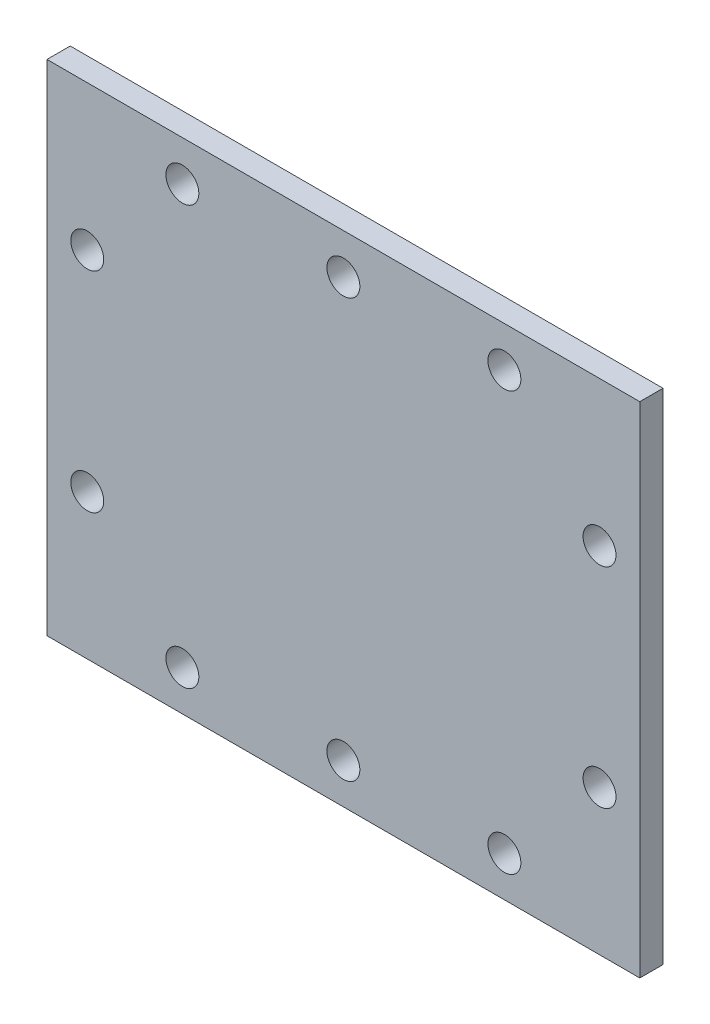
ISO-10303-21;
HEADER;
FILE_DESCRIPTION(('STEP AP214'),'2;1');
FILE_NAME('part.step','',(''),(''),'','','');
FILE_SCHEMA(('AUTOMOTIVE_DESIGN { 1 0 10303 214 1 1 1 1 }'));
ENDSEC;
DATA;
#1=APPLICATION_CONTEXT('core data for automotive mechanical design processes');
#2=APPLICATION_PROTOCOL_DEFINITION('international standard','automotive_design',2000,#1);
#3=PRODUCT_CONTEXT('',#1,'mechanical');
#4=PRODUCT('Part','Part','',(#3));
#5=PRODUCT_RELATED_PRODUCT_CATEGORY('part','',(#4));
#6=PRODUCT_DEFINITION_FORMATION('','',#4);
#7=PRODUCT_DEFINITION_CONTEXT('part definition',#1,'design');
#8=PRODUCT_DEFINITION('design','',#6,#7);
#9=PRODUCT_DEFINITION_SHAPE('','',#8);
#10=(LENGTH_UNIT() NAMED_UNIT(*) SI_UNIT(.MILLI.,.METRE.));
#11=(NAMED_UNIT(*) PLANE_ANGLE_UNIT() SI_UNIT($,.RADIAN.));
#12=(NAMED_UNIT(*) SI_UNIT($,.STERADIAN.) SOLID_ANGLE_UNIT());
#13=UNCERTAINTY_MEASURE_WITH_UNIT(LENGTH_MEASURE(1.E-05),#10,'distance_accuracy_value','');
#14=(GEOMETRIC_REPRESENTATION_CONTEXT(3) GLOBAL_UNCERTAINTY_ASSIGNED_CONTEXT((#13)) GLOBAL_UNIT_ASSIGNED_CONTEXT((#10,
#11,#12)) REPRESENTATION_CONTEXT('',''));
#15=CARTESIAN_POINT('',(0.,0.,0.));
#16=DIRECTION('',(0.,0.,1.));
#17=DIRECTION('',(1.,0.,0.));
#18=AXIS2_PLACEMENT_3D('',#15,#16,#17);
#19=CARTESIAN_POINT('',(0.,0.,3.175));
#20=DIRECTION('',(1.,0.,0.));
#21=DIRECTION('',(0.,1.,0.));
#22=AXIS2_PLACEMENT_3D('',#19,#20,#21);
#23=PLANE('',#22);
#24=DIRECTION('',(0.,-1.,0.));
#25=VECTOR('',#24,1.);
#26=CARTESIAN_POINT('',(0.,0.,0.));
#27=LINE('',#26,#25);
#28=CARTESIAN_POINT('',(0.,68.2,0.));
#29=VERTEX_POINT('',#28);
#30=CARTESIAN_POINT('',(0.,0.,0.));
#31=VERTEX_POINT('',#30);
#32=EDGE_CURVE('E257',#29,#31,#27,.T.);
#33=ORIENTED_EDGE('',*,*,#32,.T.);
#34=DIRECTION('',(0.,0.,-1.));
#35=VECTOR('',#34,1.);
#36=CARTESIAN_POINT('',(0.,0.,3.175));
#37=LINE('',#36,#35);
#38=CARTESIAN_POINT('',(0.,0.,3.175));
#39=VERTEX_POINT('',#38);
#40=EDGE_CURVE('E12',#39,#31,#37,.T.);
#41=ORIENTED_EDGE('',*,*,#40,.F.);
#42=DIRECTION('',(0.,-1.,0.));
#43=VECTOR('',#42,1.);
#44=CARTESIAN_POINT('',(0.,0.,3.175));
#45=LINE('',#44,#43);
#46=CARTESIAN_POINT('',(0.,68.2,3.175));
#47=VERTEX_POINT('',#46);
#48=EDGE_CURVE('E111',#47,#39,#45,.T.);
#49=ORIENTED_EDGE('',*,*,#48,.F.);
#50=DIRECTION('',(0.,0.,-1.));
#51=VECTOR('',#50,1.);
#52=CARTESIAN_POINT('',(0.,68.2,3.175));
#53=LINE('',#52,#51);
#54=EDGE_CURVE('E124',#47,#29,#53,.T.);
#55=ORIENTED_EDGE('',*,*,#54,.T.);
#56=EDGE_LOOP('',(#33,#41,#49,#55));
#57=FACE_BOUND('',#56,.T.);
#58=ADVANCED_FACE('F49',(#57),#23,.F.);
#59=CARTESIAN_POINT('',(0.,0.,3.175));
#60=DIRECTION('',(0.,1.,0.));
#61=DIRECTION('',(0.,0.,1.));
#62=AXIS2_PLACEMENT_3D('',#59,#60,#61);
#63=PLANE('',#62);
#64=DIRECTION('',(1.,0.,0.));
#65=VECTOR('',#64,1.);
#66=CARTESIAN_POINT('',(0.,0.,0.));
#67=LINE('',#66,#65);
#68=CARTESIAN_POINT('',(81.,0.,0.));
#69=VERTEX_POINT('',#68);
#70=EDGE_CURVE('E116',#31,#69,#67,.T.);
#71=ORIENTED_EDGE('',*,*,#70,.T.);
#72=DIRECTION('',(0.,0.,-1.));
#73=VECTOR('',#72,1.);
#74=CARTESIAN_POINT('',(81.,0.,3.175));
#75=LINE('',#74,#73);
#76=CARTESIAN_POINT('',(81.,0.,3.175));
#77=VERTEX_POINT('',#76);
#78=EDGE_CURVE('E60',#77,#69,#75,.T.);
#79=ORIENTED_EDGE('',*,*,#78,.F.);
#80=DIRECTION('',(1.,0.,0.));
#81=VECTOR('',#80,1.);
#82=CARTESIAN_POINT('',(0.,0.,3.175));
#83=LINE('',#82,#81);
#84=EDGE_CURVE('E106',#39,#77,#83,.T.);
#85=ORIENTED_EDGE('',*,*,#84,.F.);
#86=ORIENTED_EDGE('',*,*,#40,.T.);
#87=EDGE_LOOP('',(#71,#79,#85,#86));
#88=FACE_BOUND('',#87,.T.);
#89=ADVANCED_FACE('F115',(#88),#63,.F.);
#90=CARTESIAN_POINT('',(81.,0.,3.175));
#91=DIRECTION('',(-1.,0.,0.));
#92=DIRECTION('',(0.,-1.,0.));
#93=AXIS2_PLACEMENT_3D('',#90,#91,#92);
#94=PLANE('',#93);
#95=DIRECTION('',(0.,1.,0.));
#96=VECTOR('',#95,1.);
#97=CARTESIAN_POINT('',(81.,0.,0.));
#98=LINE('',#97,#96);
#99=CARTESIAN_POINT('',(81.,68.2,0.));
#100=VERTEX_POINT('',#99);
#101=EDGE_CURVE('E91',#69,#100,#98,.T.);
#102=ORIENTED_EDGE('',*,*,#101,.T.);
#103=DIRECTION('',(0.,0.,-1.));
#104=VECTOR('',#103,1.);
#105=CARTESIAN_POINT('',(81.,68.2,3.175));
#106=LINE('',#105,#104);
#107=CARTESIAN_POINT('',(81.,68.2,3.175));
#108=VERTEX_POINT('',#107);
#109=EDGE_CURVE('E118',#108,#100,#106,.T.);
#110=ORIENTED_EDGE('',*,*,#109,.F.);
#111=DIRECTION('',(0.,1.,0.));
#112=VECTOR('',#111,1.);
#113=CARTESIAN_POINT('',(81.,0.,3.175));
#114=LINE('',#113,#112);
#115=EDGE_CURVE('E109',#77,#108,#114,.T.);
#116=ORIENTED_EDGE('',*,*,#115,.F.);
#117=ORIENTED_EDGE('',*,*,#78,.T.);
#118=EDGE_LOOP('',(#102,#110,#116,#117));
#119=FACE_BOUND('',#118,.T.);
#120=ADVANCED_FACE('F119',(#119),#94,.F.);
#121=CARTESIAN_POINT('',(0.,68.2,3.175));
#122=DIRECTION('',(0.,-1.,0.));
#123=DIRECTION('',(0.,0.,-1.));
#124=AXIS2_PLACEMENT_3D('',#121,#122,#123);
#125=PLANE('',#124);
#126=DIRECTION('',(-1.,0.,0.));
#127=VECTOR('',#126,1.);
#128=CARTESIAN_POINT('',(0.,68.2,0.));
#129=LINE('',#128,#127);
#130=EDGE_CURVE('E99',#100,#29,#129,.T.);
#131=ORIENTED_EDGE('',*,*,#130,.T.);
#132=ORIENTED_EDGE('',*,*,#54,.F.);
#133=DIRECTION('',(-1.,0.,0.));
#134=VECTOR('',#133,1.);
#135=CARTESIAN_POINT('',(0.,68.2,3.175));
#136=LINE('',#135,#134);
#137=EDGE_CURVE('E70',#108,#47,#136,.T.);
#138=ORIENTED_EDGE('',*,*,#137,.F.);
#139=ORIENTED_EDGE('',*,*,#109,.T.);
#140=EDGE_LOOP('',(#131,#132,#138,#139));
#141=FACE_BOUND('',#140,.T.);
#142=ADVANCED_FACE('F286',(#141),#125,.F.);
#143=CARTESIAN_POINT('',(0.,0.,3.175));
#144=DIRECTION('',(0.,0.,-1.));
#145=DIRECTION('',(-1.,0.,0.));
#146=AXIS2_PLACEMENT_3D('',#143,#144,#145);
#147=PLANE('',#146);
#148=CARTESIAN_POINT('',(40.5,5.5,3.175));
#149=DIRECTION('',(0.,0.,1.));
#150=DIRECTION('',(1.,0.,0.));
#151=AXIS2_PLACEMENT_3D('',#148,#149,#150);
#152=CIRCLE('',#151,2.25);
#153=CARTESIAN_POINT('',(42.75,5.5,3.175));
#154=VERTEX_POINT('',#153);
#155=EDGE_CURVE('E158',#154,#154,#152,.T.);
#156=ORIENTED_EDGE('',*,*,#155,.F.);
#157=EDGE_LOOP('',(#156));
#158=FACE_BOUND('',#157,.T.);
#159=CARTESIAN_POINT('',(62.5,5.5,3.175));
#160=DIRECTION('',(0.,0.,1.));
#161=DIRECTION('',(1.,0.,0.));
#162=AXIS2_PLACEMENT_3D('',#159,#160,#161);
#163=CIRCLE('',#162,2.25);
#164=CARTESIAN_POINT('',(64.75,5.5,3.175));
#165=VERTEX_POINT('',#164);
#166=EDGE_CURVE('E166',#165,#165,#163,.T.);
#167=ORIENTED_EDGE('',*,*,#166,.F.);
#168=EDGE_LOOP('',(#167));
#169=FACE_BOUND('',#168,.T.);
#170=CARTESIAN_POINT('',(18.5,5.49999999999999,3.175));
#171=DIRECTION('',(0.,0.,1.));
#172=DIRECTION('',(1.,0.,0.));
#173=AXIS2_PLACEMENT_3D('',#170,#171,#172);
#174=CIRCLE('',#173,2.25);
#175=CARTESIAN_POINT('',(20.75,5.49999999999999,3.175));
#176=VERTEX_POINT('',#175);
#177=EDGE_CURVE('E176',#176,#176,#174,.T.);
#178=ORIENTED_EDGE('',*,*,#177,.F.);
#179=EDGE_LOOP('',(#178));
#180=FACE_BOUND('',#179,.T.);
#181=CARTESIAN_POINT('',(5.49999999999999,19.8,3.175));
#182=DIRECTION('',(0.,0.,1.));
#183=DIRECTION('',(1.,0.,0.));
#184=AXIS2_PLACEMENT_3D('',#181,#182,#183);
#185=CIRCLE('',#184,2.25);
#186=CARTESIAN_POINT('',(7.74999999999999,19.8,3.175));
#187=VERTEX_POINT('',#186);
#188=EDGE_CURVE('E188',#187,#187,#185,.T.);
#189=ORIENTED_EDGE('',*,*,#188,.F.);
#190=EDGE_LOOP('',(#189));
#191=FACE_BOUND('',#190,.T.);
#192=CARTESIAN_POINT('',(5.49999999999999,48.4,3.175));
#193=DIRECTION('',(0.,0.,1.));
#194=DIRECTION('',(1.,0.,0.));
#195=AXIS2_PLACEMENT_3D('',#192,#193,#194);
#196=CIRCLE('',#195,2.25);
#197=CARTESIAN_POINT('',(7.74999999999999,48.4,3.175));
#198=VERTEX_POINT('',#197);
#199=EDGE_CURVE('E200',#198,#198,#196,.T.);
#200=ORIENTED_EDGE('',*,*,#199,.F.);
#201=EDGE_LOOP('',(#200));
#202=FACE_BOUND('',#201,.T.);
#203=CARTESIAN_POINT('',(18.5,62.7,3.175));
#204=DIRECTION('',(0.,0.,1.));
#205=DIRECTION('',(1.,0.,0.));
#206=AXIS2_PLACEMENT_3D('',#203,#204,#205);
#207=CIRCLE('',#206,2.25);
#208=CARTESIAN_POINT('',(20.75,62.7,3.175));
#209=VERTEX_POINT('',#208);
#210=EDGE_CURVE('E209',#209,#209,#207,.T.);
#211=ORIENTED_EDGE('',*,*,#210,.F.);
#212=EDGE_LOOP('',(#211));
#213=FACE_BOUND('',#212,.T.);
#214=CARTESIAN_POINT('',(62.5,62.7,3.175));
#215=DIRECTION('',(0.,0.,1.));
#216=DIRECTION('',(1.,0.,0.));
#217=AXIS2_PLACEMENT_3D('',#214,#215,#216);
#218=CIRCLE('',#217,2.25);
#219=CARTESIAN_POINT('',(64.75,62.7,3.175));
#220=VERTEX_POINT('',#219);
#221=EDGE_CURVE('E221',#220,#220,#218,.T.);
#222=ORIENTED_EDGE('',*,*,#221,.F.);
#223=EDGE_LOOP('',(#222));
#224=FACE_BOUND('',#223,.T.);
#225=CARTESIAN_POINT('',(75.5,48.4,3.175));
#226=DIRECTION('',(0.,0.,1.));
#227=DIRECTION('',(1.,0.,0.));
#228=AXIS2_PLACEMENT_3D('',#225,#226,#227);
#229=CIRCLE('',#228,2.25);
#230=CARTESIAN_POINT('',(77.75,48.4,3.175));
#231=VERTEX_POINT('',#230);
#232=EDGE_CURVE('E230',#231,#231,#229,.T.);
#233=ORIENTED_EDGE('',*,*,#232,.F.);
#234=EDGE_LOOP('',(#233));
#235=FACE_BOUND('',#234,.T.);
#236=CARTESIAN_POINT('',(75.5,19.8,3.175));
#237=DIRECTION('',(0.,0.,1.));
#238=DIRECTION('',(1.,0.,0.));
#239=AXIS2_PLACEMENT_3D('',#236,#237,#238);
#240=CIRCLE('',#239,2.25);
#241=CARTESIAN_POINT('',(77.75,19.8,3.175));
#242=VERTEX_POINT('',#241);
#243=EDGE_CURVE('E239',#242,#242,#240,.T.);
#244=ORIENTED_EDGE('',*,*,#243,.F.);
#245=EDGE_LOOP('',(#244));
#246=FACE_BOUND('',#245,.T.);
#247=CARTESIAN_POINT('',(40.5,62.7,3.175));
#248=DIRECTION('',(0.,0.,1.));
#249=DIRECTION('',(1.,0.,0.));
#250=AXIS2_PLACEMENT_3D('',#247,#248,#249);
#251=CIRCLE('',#250,2.25);
#252=CARTESIAN_POINT('',(42.75,62.7,3.175));
#253=VERTEX_POINT('',#252);
#254=EDGE_CURVE('E250',#253,#253,#251,.T.);
#255=ORIENTED_EDGE('',*,*,#254,.F.);
#256=EDGE_LOOP('',(#255));
#257=FACE_BOUND('',#256,.T.);
#258=ORIENTED_EDGE('',*,*,#48,.T.);
#259=ORIENTED_EDGE('',*,*,#84,.T.);
#260=ORIENTED_EDGE('',*,*,#115,.T.);
#261=ORIENTED_EDGE('',*,*,#137,.T.);
#262=EDGE_LOOP('',(#258,#259,#260,#261));
#263=FACE_BOUND('',#262,.T.);
#264=ADVANCED_FACE('F107',(#158,#169,#180,#191,#202,#213,#224,#235,#246,#257,#263),#147,.F.);
#265=CARTESIAN_POINT('',(0.,0.,0.));
#266=DIRECTION('',(0.,0.,-1.));
#267=DIRECTION('',(-1.,0.,0.));
#268=AXIS2_PLACEMENT_3D('',#265,#266,#267);
#269=PLANE('',#268);
#270=CARTESIAN_POINT('',(40.5,5.5,0.));
#271=DIRECTION('',(0.,0.,1.));
#272=DIRECTION('',(1.,0.,0.));
#273=AXIS2_PLACEMENT_3D('',#270,#271,#272);
#274=CIRCLE('',#273,2.25);
#275=CARTESIAN_POINT('',(42.75,5.5,0.));
#276=VERTEX_POINT('',#275);
#277=EDGE_CURVE('E162',#276,#276,#274,.T.);
#278=ORIENTED_EDGE('',*,*,#277,.T.);
#279=EDGE_LOOP('',(#278));
#280=FACE_BOUND('',#279,.T.);
#281=CARTESIAN_POINT('',(62.5,5.5,0.));
#282=DIRECTION('',(0.,0.,1.));
#283=DIRECTION('',(1.,0.,0.));
#284=AXIS2_PLACEMENT_3D('',#281,#282,#283);
#285=CIRCLE('',#284,2.25);
#286=CARTESIAN_POINT('',(64.75,5.5,0.));
#287=VERTEX_POINT('',#286);
#288=EDGE_CURVE('E171',#287,#287,#285,.T.);
#289=ORIENTED_EDGE('',*,*,#288,.T.);
#290=EDGE_LOOP('',(#289));
#291=FACE_BOUND('',#290,.T.);
#292=CARTESIAN_POINT('',(18.5,5.49999999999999,0.));
#293=DIRECTION('',(0.,0.,1.));
#294=DIRECTION('',(1.,0.,0.));
#295=AXIS2_PLACEMENT_3D('',#292,#293,#294);
#296=CIRCLE('',#295,2.25);
#297=CARTESIAN_POINT('',(20.75,5.49999999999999,0.));
#298=VERTEX_POINT('',#297);
#299=EDGE_CURVE('E183',#298,#298,#296,.T.);
#300=ORIENTED_EDGE('',*,*,#299,.T.);
#301=EDGE_LOOP('',(#300));
#302=FACE_BOUND('',#301,.T.);
#303=CARTESIAN_POINT('',(5.49999999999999,19.8,0.));
#304=DIRECTION('',(0.,0.,1.));
#305=DIRECTION('',(1.,0.,0.));
#306=AXIS2_PLACEMENT_3D('',#303,#304,#305);
#307=CIRCLE('',#306,2.25);
#308=CARTESIAN_POINT('',(7.74999999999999,19.8,0.));
#309=VERTEX_POINT('',#308);
#310=EDGE_CURVE('E192',#309,#309,#307,.T.);
#311=ORIENTED_EDGE('',*,*,#310,.T.);
#312=EDGE_LOOP('',(#311));
#313=FACE_BOUND('',#312,.T.);
#314=CARTESIAN_POINT('',(5.49999999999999,48.4,0.));
#315=DIRECTION('',(0.,0.,1.));
#316=DIRECTION('',(1.,0.,0.));
#317=AXIS2_PLACEMENT_3D('',#314,#315,#316);
#318=CIRCLE('',#317,2.25);
#319=CARTESIAN_POINT('',(7.74999999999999,48.4,0.));
#320=VERTEX_POINT('',#319);
#321=EDGE_CURVE('E205',#320,#320,#318,.T.);
#322=ORIENTED_EDGE('',*,*,#321,.T.);
#323=EDGE_LOOP('',(#322));
#324=FACE_BOUND('',#323,.T.);
#325=CARTESIAN_POINT('',(18.5,62.7,0.));
#326=DIRECTION('',(0.,0.,1.));
#327=DIRECTION('',(1.,0.,0.));
#328=AXIS2_PLACEMENT_3D('',#325,#326,#327);
#329=CIRCLE('',#328,2.25);
#330=CARTESIAN_POINT('',(20.75,62.7,0.));
#331=VERTEX_POINT('',#330);
#332=EDGE_CURVE('E216',#331,#331,#329,.T.);
#333=ORIENTED_EDGE('',*,*,#332,.T.);
#334=EDGE_LOOP('',(#333));
#335=FACE_BOUND('',#334,.T.);
#336=CARTESIAN_POINT('',(62.5,62.7,0.));
#337=DIRECTION('',(0.,0.,1.));
#338=DIRECTION('',(1.,0.,0.));
#339=AXIS2_PLACEMENT_3D('',#336,#337,#338);
#340=CIRCLE('',#339,2.25);
#341=CARTESIAN_POINT('',(64.75,62.7,0.));
#342=VERTEX_POINT('',#341);
#343=EDGE_CURVE('E225',#342,#342,#340,.T.);
#344=ORIENTED_EDGE('',*,*,#343,.T.);
#345=EDGE_LOOP('',(#344));
#346=FACE_BOUND('',#345,.T.);
#347=CARTESIAN_POINT('',(75.5,48.4,0.));
#348=DIRECTION('',(0.,0.,1.));
#349=DIRECTION('',(1.,0.,0.));
#350=AXIS2_PLACEMENT_3D('',#347,#348,#349);
#351=CIRCLE('',#350,2.25);
#352=CARTESIAN_POINT('',(77.75,48.4,0.));
#353=VERTEX_POINT('',#352);
#354=EDGE_CURVE('E235',#353,#353,#351,.T.);
#355=ORIENTED_EDGE('',*,*,#354,.T.);
#356=EDGE_LOOP('',(#355));
#357=FACE_BOUND('',#356,.T.);
#358=CARTESIAN_POINT('',(75.5,19.8,0.));
#359=DIRECTION('',(0.,0.,1.));
#360=DIRECTION('',(1.,0.,0.));
#361=AXIS2_PLACEMENT_3D('',#358,#359,#360);
#362=CIRCLE('',#361,2.25);
#363=CARTESIAN_POINT('',(77.75,19.8,0.));
#364=VERTEX_POINT('',#363);
#365=EDGE_CURVE('E246',#364,#364,#362,.T.);
#366=ORIENTED_EDGE('',*,*,#365,.T.);
#367=EDGE_LOOP('',(#366));
#368=FACE_BOUND('',#367,.T.);
#369=CARTESIAN_POINT('',(40.5,62.7,0.));
#370=DIRECTION('',(0.,0.,1.));
#371=DIRECTION('',(1.,0.,0.));
#372=AXIS2_PLACEMENT_3D('',#369,#370,#371);
#373=CIRCLE('',#372,2.25);
#374=CARTESIAN_POINT('',(42.75,62.7,0.));
#375=VERTEX_POINT('',#374);
#376=EDGE_CURVE('E253',#375,#375,#373,.T.);
#377=ORIENTED_EDGE('',*,*,#376,.T.);
#378=EDGE_LOOP('',(#377));
#379=FACE_BOUND('',#378,.T.);
#380=ORIENTED_EDGE('',*,*,#32,.F.);
#381=ORIENTED_EDGE('',*,*,#130,.F.);
#382=ORIENTED_EDGE('',*,*,#101,.F.);
#383=ORIENTED_EDGE('',*,*,#70,.F.);
#384=EDGE_LOOP('',(#380,#381,#382,#383));
#385=FACE_BOUND('',#384,.T.);
#386=ADVANCED_FACE('F274',(#280,#291,#302,#313,#324,#335,#346,#357,#368,#379,#385),#269,.T.);
#387=CARTESIAN_POINT('',(40.5,62.7,3.175));
#388=DIRECTION('',(0.,0.,1.));
#389=DIRECTION('',(1.,0.,0.));
#390=AXIS2_PLACEMENT_3D('',#387,#388,#389);
#391=CYLINDRICAL_SURFACE('',#390,2.25);
#392=ORIENTED_EDGE('',*,*,#376,.F.);
#393=EDGE_LOOP('',(#392));
#394=FACE_BOUND('',#393,.T.);
#395=ORIENTED_EDGE('',*,*,#254,.T.);
#396=EDGE_LOOP('',(#395));
#397=FACE_BOUND('',#396,.T.);
#398=ADVANCED_FACE('F276',(#394,#397),#391,.F.);
#399=CARTESIAN_POINT('',(75.5,19.8,3.175));
#400=DIRECTION('',(0.,0.,1.));
#401=DIRECTION('',(1.,0.,0.));
#402=AXIS2_PLACEMENT_3D('',#399,#400,#401);
#403=CYLINDRICAL_SURFACE('',#402,2.25);
#404=ORIENTED_EDGE('',*,*,#365,.F.);
#405=EDGE_LOOP('',(#404));
#406=FACE_BOUND('',#405,.T.);
#407=ORIENTED_EDGE('',*,*,#243,.T.);
#408=EDGE_LOOP('',(#407));
#409=FACE_BOUND('',#408,.T.);
#410=ADVANCED_FACE('F283',(#406,#409),#403,.F.);
#411=CARTESIAN_POINT('',(75.5,48.4,3.175));
#412=DIRECTION('',(0.,0.,1.));
#413=DIRECTION('',(1.,0.,0.));
#414=AXIS2_PLACEMENT_3D('',#411,#412,#413);
#415=CYLINDRICAL_SURFACE('',#414,2.25);
#416=ORIENTED_EDGE('',*,*,#354,.F.);
#417=EDGE_LOOP('',(#416));
#418=FACE_BOUND('',#417,.T.);
#419=ORIENTED_EDGE('',*,*,#232,.T.);
#420=EDGE_LOOP('',(#419));
#421=FACE_BOUND('',#420,.T.);
#422=ADVANCED_FACE('F328',(#418,#421),#415,.F.);
#423=CARTESIAN_POINT('',(62.5,62.7,3.175));
#424=DIRECTION('',(0.,0.,1.));
#425=DIRECTION('',(1.,0.,0.));
#426=AXIS2_PLACEMENT_3D('',#423,#424,#425);
#427=CYLINDRICAL_SURFACE('',#426,2.25);
#428=ORIENTED_EDGE('',*,*,#343,.F.);
#429=EDGE_LOOP('',(#428));
#430=FACE_BOUND('',#429,.T.);
#431=ORIENTED_EDGE('',*,*,#221,.T.);
#432=EDGE_LOOP('',(#431));
#433=FACE_BOUND('',#432,.T.);
#434=ADVANCED_FACE('F337',(#430,#433),#427,.F.);
#435=CARTESIAN_POINT('',(18.5,62.7,3.175));
#436=DIRECTION('',(0.,0.,1.));
#437=DIRECTION('',(1.,0.,0.));
#438=AXIS2_PLACEMENT_3D('',#435,#436,#437);
#439=CYLINDRICAL_SURFACE('',#438,2.25);
#440=ORIENTED_EDGE('',*,*,#332,.F.);
#441=EDGE_LOOP('',(#440));
#442=FACE_BOUND('',#441,.T.);
#443=ORIENTED_EDGE('',*,*,#210,.T.);
#444=EDGE_LOOP('',(#443));
#445=FACE_BOUND('',#444,.T.);
#446=ADVANCED_FACE('F346',(#442,#445),#439,.F.);
#447=CARTESIAN_POINT('',(5.49999999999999,48.4,3.175));
#448=DIRECTION('',(0.,0.,1.));
#449=DIRECTION('',(1.,0.,0.));
#450=AXIS2_PLACEMENT_3D('',#447,#448,#449);
#451=CYLINDRICAL_SURFACE('',#450,2.25);
#452=ORIENTED_EDGE('',*,*,#321,.F.);
#453=EDGE_LOOP('',(#452));
#454=FACE_BOUND('',#453,.T.);
#455=ORIENTED_EDGE('',*,*,#199,.T.);
#456=EDGE_LOOP('',(#455));
#457=FACE_BOUND('',#456,.T.);
#458=ADVANCED_FACE('F355',(#454,#457),#451,.F.);
#459=CARTESIAN_POINT('',(5.49999999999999,19.8,3.175));
#460=DIRECTION('',(0.,0.,1.));
#461=DIRECTION('',(1.,0.,0.));
#462=AXIS2_PLACEMENT_3D('',#459,#460,#461);
#463=CYLINDRICAL_SURFACE('',#462,2.25);
#464=ORIENTED_EDGE('',*,*,#310,.F.);
#465=EDGE_LOOP('',(#464));
#466=FACE_BOUND('',#465,.T.);
#467=ORIENTED_EDGE('',*,*,#188,.T.);
#468=EDGE_LOOP('',(#467));
#469=FACE_BOUND('',#468,.T.);
#470=ADVANCED_FACE('F364',(#466,#469),#463,.F.);
#471=CARTESIAN_POINT('',(18.5,5.49999999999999,3.175));
#472=DIRECTION('',(0.,0.,1.));
#473=DIRECTION('',(1.,0.,0.));
#474=AXIS2_PLACEMENT_3D('',#471,#472,#473);
#475=CYLINDRICAL_SURFACE('',#474,2.25);
#476=ORIENTED_EDGE('',*,*,#299,.F.);
#477=EDGE_LOOP('',(#476));
#478=FACE_BOUND('',#477,.T.);
#479=ORIENTED_EDGE('',*,*,#177,.T.);
#480=EDGE_LOOP('',(#479));
#481=FACE_BOUND('',#480,.T.);
#482=ADVANCED_FACE('F373',(#478,#481),#475,.F.);
#483=CARTESIAN_POINT('',(62.5,5.5,3.175));
#484=DIRECTION('',(0.,0.,1.));
#485=DIRECTION('',(1.,0.,0.));
#486=AXIS2_PLACEMENT_3D('',#483,#484,#485);
#487=CYLINDRICAL_SURFACE('',#486,2.25);
#488=ORIENTED_EDGE('',*,*,#288,.F.);
#489=EDGE_LOOP('',(#488));
#490=FACE_BOUND('',#489,.T.);
#491=ORIENTED_EDGE('',*,*,#166,.T.);
#492=EDGE_LOOP('',(#491));
#493=FACE_BOUND('',#492,.T.);
#494=ADVANCED_FACE('F382',(#490,#493),#487,.F.);
#495=CARTESIAN_POINT('',(40.5,5.5,3.175));
#496=DIRECTION('',(0.,0.,1.));
#497=DIRECTION('',(1.,0.,0.));
#498=AXIS2_PLACEMENT_3D('',#495,#496,#497);
#499=CYLINDRICAL_SURFACE('',#498,2.25);
#500=ORIENTED_EDGE('',*,*,#277,.F.);
#501=EDGE_LOOP('',(#500));
#502=FACE_BOUND('',#501,.T.);
#503=ORIENTED_EDGE('',*,*,#155,.T.);
#504=EDGE_LOOP('',(#503));
#505=FACE_BOUND('',#504,.T.);
#506=ADVANCED_FACE('F391',(#502,#505),#499,.F.);
#507=CLOSED_SHELL('',(#58,#89,#120,#142,#264,#386,#398,#410,#422,#434,#446,#458,#470,#482,#494,#506));
#508=MANIFOLD_SOLID_BREP('B2',#507);
#509=ADVANCED_BREP_SHAPE_REPRESENTATION('',(#18,#508),#14);
#510=SHAPE_DEFINITION_REPRESENTATION(#9,#509);
ENDSEC;
END-ISO-10303-21;
